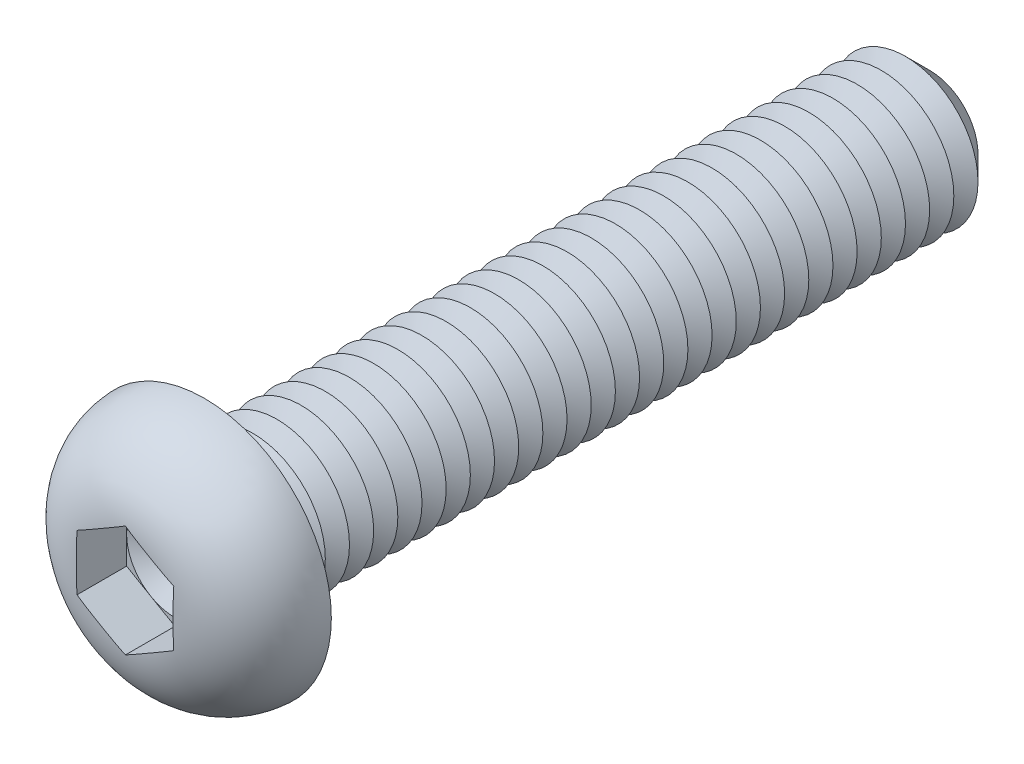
from build123d import *

# Parameters (mm, degrees)
CUT_EXTRUDE1_DEPTH  = 2.08
SKETCH4_R           = 3
BOSS_EXTRUDE1_DEPTH = 30
CHAMFER1_SIZE       = 1
LPATTERN1_COUNT     = 28
LPATTERN1_PITCH     = 1
FILLET2_R           = 0.5


with BuildPart() as part:
    # Sketch2 → Revolve1 (revolve)
    with BuildSketch(Plane(origin=(0, 0, 0), x_dir=(0, 0, -1), z_dir=(1, 0, 0)), mode=Mode.PRIVATE) as revolve1_sk:
        with BuildLine():
            Line((0, 0), (-3.3, 0))
            Line((-3.3, 0), (-3.3, 1.851470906))
            ThreePointArc((-3.3, 1.851470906), (-2.339262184, 4.220014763), (0, 5.25))
            Line((0, 5.25), (0, 0))
        make_face()
    revolve(revolve1_sk.sketch.rotate(Axis((0, 0, 47.934239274), (0, 0, -1)), 90), axis=Axis((0, 0, 47.934239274), (0, 0, -1)))

    # Sketch3 → Cut-Extrude1 (cut)
    with BuildSketch(Plane.XY.offset(3.3)):
        Polygon((0, 2.309401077), (-2, 1.154700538), (-2, -1.154700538), (0, -2.309401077), (2, -1.154700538), (2, 1.154700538), align=None)
    extrude(amount=-CUT_EXTRUDE1_DEPTH, mode=Mode.SUBTRACT)

    # Sketch4 → Boss-Extrude1 (add)
    with BuildSketch(Plane(origin=(0, 0, 0), x_dir=(-1, 0, 0), z_dir=(0, 0, -1))):
        Circle(SKETCH4_R)
    extrude(amount=BOSS_EXTRUDE1_DEPTH)

    # Chamfer1
    chamfer1_edges = [part.edges().sort_by_distance(p)[0] for p in [
        (3, 0, -30),
    ]]
    chamfer(chamfer1_edges, length=CHAMFER1_SIZE)

    # Sketch5 → Cut-Revolve1 (revolve, cut)
    with BuildSketch(Plane(origin=(0, 0, 0), x_dir=(0, 0, -1), z_dir=(1, 0, 0)), mode=Mode.PRIVATE) as cut_revolve1_sk:
        Polygon((1, 3), (2, 3), (1.5, 2.133974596), align=None)
    cut_revolve1 = revolve(cut_revolve1_sk.sketch.rotate(Axis((0, 0, 47.934239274), (0, 0, -1)), 90), axis=Axis((0, 0, 47.934239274), (0, 0, -1)), mode=Mode.SUBTRACT)

    # LPattern1: Cut-Revolve1 ×28
    with Locations(*[(0, 0, -i * LPATTERN1_PITCH) for i in range(1, LPATTERN1_COUNT)]):
        add(cut_revolve1, mode=Mode.SUBTRACT)

    # Fillet2
    fillet2_edges = [part.edges().sort_by_distance(p)[0] for p in [
        (3, 0, 0),
    ]]
    fillet(fillet2_edges, radius=FILLET2_R)

    # Cut-Extrude2 cone 1 section (on through the dimple's axis) → Cut-Extrude2 (revolve, cut)
    with BuildSketch(Plane(origin=(0, 0, 1.22), x_dir=(0, -1, 0), z_dir=(1, 0, 0))):
        Polygon((0, 0), (2, 0), (0, 1.154700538), align=None)
    revolve(axis=Axis((0, 0, 1.22), (0, 0, -1)), mode=Mode.SUBTRACT)


solid = part.part
